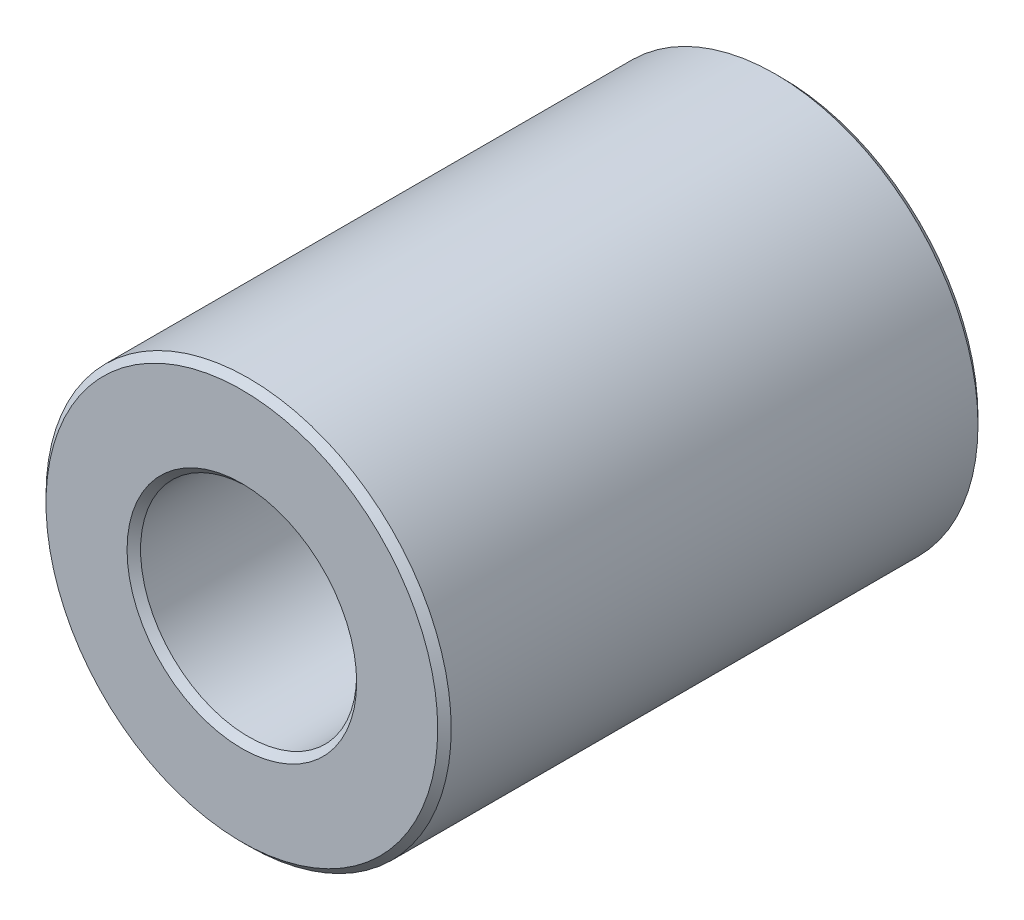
from build123d import *

# Parameters (mm, degrees)
SKETCH1_R           = 3
SKETCH1_R_2         = 1.6
BOSS_EXTRUDE2_DEPTH = 4
CHAMFER3_SIZE       = 0.1


with BuildPart() as part:
    # Sketch1 → Boss-Extrude2 (new, symmetric)
    with BuildSketch(Plane.XY):
        Circle(SKETCH1_R)
        Circle(SKETCH1_R_2, mode=Mode.SUBTRACT)
    extrude(amount=BOSS_EXTRUDE2_DEPTH, both=True)

    # Chamfer3
    chamfer3_edges = [part.edges().sort_by_distance(p)[0] for p in [
        (-3, 0, -4),
        (-3, 0, 4),
        (-1.6, 0, -4),
        (-1.6, 0, 4),
    ]]
    chamfer(chamfer3_edges, length=CHAMFER3_SIZE)


solid = part.part
